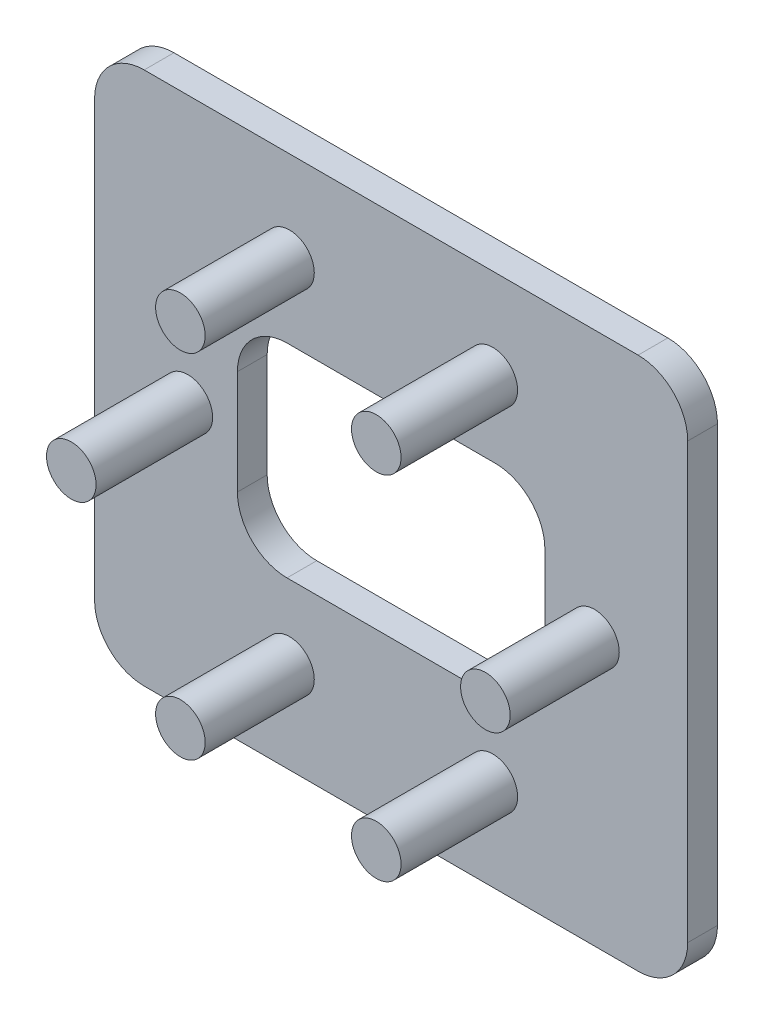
from build123d import *

# Parameters (mm, degrees)
SKETCH_1_R          = 2.5
EXTRUDE_1_DEPTH     = 3
SKETCH_1_4_R        = 2.5
EXTRUDE_2_DEPTH     = 14
EXTRUDE_2_2_DEPTH   = 14
EXTRUDE_2_3_DEPTH   = 14
EXTRUDE_2_4_DEPTH   = 14
EXTRUDE_2_5_DEPTH   = 14
EXTRUDE_2_6_DEPTH   = 14
SKETCH_2_R          = 2.5
EXTRUDE_3_DEPTH     = 7.75
CUT_EXTRUDE_1_DEPTH = 47.467004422


with BuildPart() as part:
    # Sketch 1 → Extrude 1 (new body)
    with BuildSketch(Plane.XY):
        with BuildLine():
            Line((-29.9, 26.9), (29.9, 26.9))
            ThreePointArc((29.9, 26.9), (33.435533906, 25.435533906), (34.9, 21.9))
            Line((34.9, 21.9), (34.9, -21.9))
            ThreePointArc((34.9, -21.9), (33.435533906, -25.435533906), (29.9, -26.9))
            Line((29.9, -26.9), (-29.9, -26.9))
            ThreePointArc((-29.9, -26.9), (-33.435533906, -25.435533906), (-34.9, -21.9))
            Line((-34.9, -21.9), (-34.9, 21.9))
            ThreePointArc((-34.9, 21.9), (-33.435533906, 25.435533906), (-29.9, 26.9))
        make_face()
        with Locations((10.25, 17.753520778)):
            Circle(SKETCH_1_R, mode=Mode.SUBTRACT)
        with Locations((-10.25, -17.753520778)):
            Circle(SKETCH_1_R, mode=Mode.SUBTRACT)
        with Locations((-10.25, 17.753520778)):
            Circle(SKETCH_1_R, mode=Mode.SUBTRACT)
        with BuildLine():
            Line((-10.5, 10.253520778), (10.5, 10.253520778))
            ThreePointArc((10.5, 10.253520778), (14.035533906, 8.789054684), (15.5, 5.253520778))
            Line((15.5, 5.253520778), (15.5, -5.253520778))
            ThreePointArc((15.5, -5.253520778), (14.035533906, -8.789054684), (10.5, -10.253520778))
            Line((10.5, -10.253520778), (-10.5, -10.253520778))
            ThreePointArc((-10.5, -10.253520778), (-14.035533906, -8.789054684), (-15.5, -5.253520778))
            Line((-15.5, -5.253520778), (-15.5, 5.253520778))
            ThreePointArc((-15.5, 5.253520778), (-14.035533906, 8.789054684), (-10.5, 10.253520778))
        make_face(mode=Mode.SUBTRACT)
    extrude(amount=EXTRUDE_1_DEPTH)

    # Sketch 3 → Cut-Extrude 1 (cut, through all)
    with BuildSketch(Plane(origin=(0, 0, 0), x_dir=(-1, 0, 0), z_dir=(0, 0, -1))):
        with BuildLine():
            Line((-29.9, -21.9), (-29.9, 21.9))
            ThreePointArc((-29.9, 21.9), (-28.435533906, 25.435533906), (-24.9, 26.9))
            Line((-24.9, 26.9), (-29.9, 26.9))
            ThreePointArc((-29.9, 26.9), (-33.435533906, 25.435533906), (-34.9, 21.9))
            Line((-34.9, 21.9), (-34.9, -21.9))
            ThreePointArc((-34.9, -21.9), (-33.435533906, -25.435533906), (-29.9, -26.9))
            Line((-29.9, -26.9), (-24.9, -26.9))
            ThreePointArc((-24.9, -26.9), (-28.435533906, -25.435533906), (-29.9, -21.9))
        make_face()
        with BuildLine():
            Line((29.9, 26.9), (24.9, 26.9))
            ThreePointArc((24.9, 26.9), (28.435533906, 25.435533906), (29.9, 21.9))
            Line((29.9, 21.9), (29.9, -21.9))
            ThreePointArc((29.9, -21.9), (28.435533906, -25.435533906), (24.9, -26.9))
            Line((24.9, -26.9), (29.9, -26.9))
            ThreePointArc((29.9, -26.9), (33.435533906, -25.435533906), (34.9, -21.9))
            Line((34.9, -21.9), (34.9, 21.9))
            ThreePointArc((34.9, 21.9), (33.435533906, 25.435533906), (29.9, 26.9))
        make_face()
    extrude(amount=-CUT_EXTRUDE_1_DEPTH, mode=Mode.SUBTRACT)


with BuildPart() as body_2:
    # Sketch 1_4 → Extrude 2 (new body)
    with BuildSketch(Plane.XY):
        with Locations((20.5, 0)):
            Circle(SKETCH_1_4_R)
    extrude(amount=EXTRUDE_2_DEPTH)


with BuildPart() as body_3:
    # Sketch 1_4 → Extrude 2 2 (new body)
    with BuildSketch(Plane.XY):
        with Locations((-20.5, 0)):
            Circle(SKETCH_1_4_R)
    extrude(amount=EXTRUDE_2_2_DEPTH)



with BuildPart() as body_4:
    # Sketch 1_4 → Extrude 2 3 (new body)
    with BuildSketch(Plane.XY):
        with Locations((10.25, 17.753520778)):
            Circle(SKETCH_1_4_R)
    extrude(amount=EXTRUDE_2_3_DEPTH)


with BuildPart() as body_5:
    # Sketch 1_4 → Extrude 2 4 (new body)
    with BuildSketch(Plane.XY):
        with Locations((10.25, -17.753520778)):
            Circle(SKETCH_1_4_R)
    extrude(amount=EXTRUDE_2_4_DEPTH)


with BuildPart() as body_6:
    # Sketch 1_4 → Extrude 2 5 (new body)
    with BuildSketch(Plane.XY):
        with Locations((-10.25, -17.753520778)):
            Circle(SKETCH_1_4_R)
    extrude(amount=EXTRUDE_2_5_DEPTH)


with BuildPart() as body_7:
    # Sketch 1_4 → Extrude 2 6 (new body)
    with BuildSketch(Plane.XY):
        with Locations((-10.25, 17.753520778)):
            Circle(SKETCH_1_4_R)
    extrude(amount=EXTRUDE_2_6_DEPTH)


with BuildPart() as body_3_1:
    add(body_3.part)

    add(body_4.part)  # Extrude 3 merges body 4

    add(body_5.part)  # Extrude 3 merges body 5
    # Sketch 2 → Extrude 3 (add)
    with BuildSketch(Plane.XY.offset(7)):
        with Locations((-20.5, 0)):
            Circle(SKETCH_2_R)
        with Locations((10.25, 17.753520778)):
            Circle(SKETCH_2_R)
        with Locations((10.25, -17.753520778)):
            Circle(SKETCH_2_R)
    extrude(amount=EXTRUDE_3_DEPTH)


solid = Compound([part.part, body_2.part, body_6.part, body_7.part, body_3_1.part])
